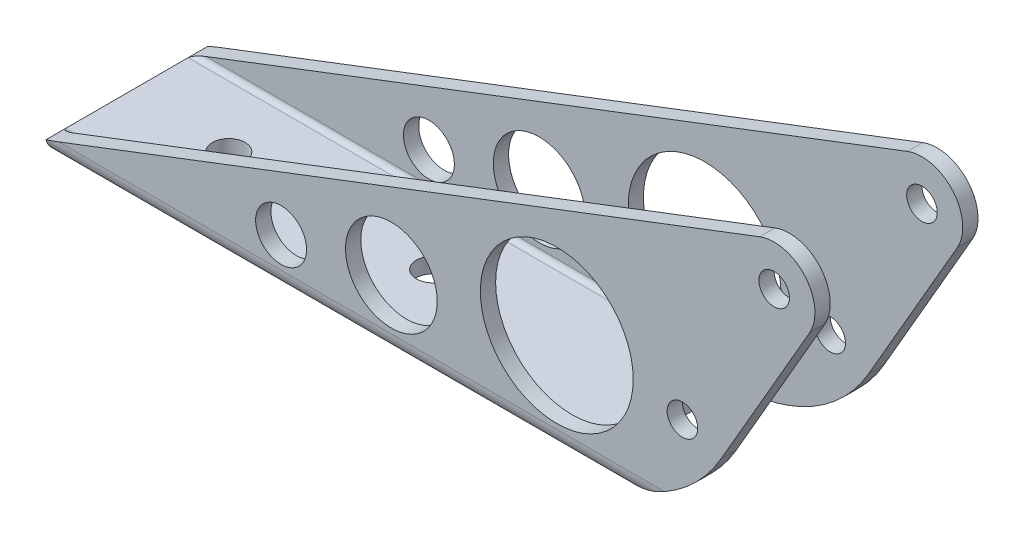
ISO-10303-21;
HEADER;
FILE_DESCRIPTION(('STEP AP214'),'2;1');
FILE_NAME('part.step','',(''),(''),'','','');
FILE_SCHEMA(('AUTOMOTIVE_DESIGN { 1 0 10303 214 1 1 1 1 }'));
ENDSEC;
DATA;
#1=APPLICATION_CONTEXT('core data for automotive mechanical design processes');
#2=APPLICATION_PROTOCOL_DEFINITION('international standard','automotive_design',2000,#1);
#3=PRODUCT_CONTEXT('',#1,'mechanical');
#4=PRODUCT('Part','Part','',(#3));
#5=PRODUCT_RELATED_PRODUCT_CATEGORY('part','',(#4));
#6=PRODUCT_DEFINITION_FORMATION('','',#4);
#7=PRODUCT_DEFINITION_CONTEXT('part definition',#1,'design');
#8=PRODUCT_DEFINITION('design','',#6,#7);
#9=PRODUCT_DEFINITION_SHAPE('','',#8);
#10=(LENGTH_UNIT() NAMED_UNIT(*) SI_UNIT(.MILLI.,.METRE.));
#11=(NAMED_UNIT(*) PLANE_ANGLE_UNIT() SI_UNIT($,.RADIAN.));
#12=(NAMED_UNIT(*) SI_UNIT($,.STERADIAN.) SOLID_ANGLE_UNIT());
#13=UNCERTAINTY_MEASURE_WITH_UNIT(LENGTH_MEASURE(1.E-05),#10,'distance_accuracy_value','');
#14=(GEOMETRIC_REPRESENTATION_CONTEXT(3) GLOBAL_UNCERTAINTY_ASSIGNED_CONTEXT((#13)) GLOBAL_UNIT_ASSIGNED_CONTEXT((#10,
#11,#12)) REPRESENTATION_CONTEXT('',''));
#15=CARTESIAN_POINT('',(0.,0.,0.));
#16=DIRECTION('',(0.,0.,1.));
#17=DIRECTION('',(1.,0.,0.));
#18=AXIS2_PLACEMENT_3D('',#15,#16,#17);
#19=CARTESIAN_POINT('',(106.524791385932,30.,-16.));
#20=DIRECTION('',(0.,0.,1.));
#21=DIRECTION('',(1.,0.,0.));
#22=AXIS2_PLACEMENT_3D('',#19,#20,#21);
#23=CYLINDRICAL_SURFACE('',#22,30.);
#24=CARTESIAN_POINT('',(106.524791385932,30.,-13.));
#25=DIRECTION('',(0.,0.,1.));
#26=DIRECTION('',(1.,0.,0.));
#27=AXIS2_PLACEMENT_3D('',#24,#25,#26);
#28=CIRCLE('',#27,30.);
#29=CARTESIAN_POINT('',(109.282483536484,0.127016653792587,-13.));
#30=VERTEX_POINT('',#29);
#31=CARTESIAN_POINT('',(132.505553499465,15.0000000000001,-13.));
#32=VERTEX_POINT('',#31);
#33=EDGE_CURVE('E236',#30,#32,#28,.T.);
#34=ORIENTED_EDGE('',*,*,#33,.F.);
#35=CARTESIAN_POINT('',(121.491420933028,4.,-16.));
#36=CARTESIAN_POINT('',(121.274329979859,3.87502624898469,-15.9999637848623));
#37=CARTESIAN_POINT('',(121.055719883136,3.75281291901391,-15.9941450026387));
#38=CARTESIAN_POINT('',(120.615999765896,3.51414923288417,-15.9722001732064));
#39=CARTESIAN_POINT('',(120.394890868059,3.39769640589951,-15.9560785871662));
#40=CARTESIAN_POINT('',(119.951007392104,3.17093489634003,-15.9148288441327));
#41=CARTESIAN_POINT('',(119.728237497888,3.06061336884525,-15.8897204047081));
#42=CARTESIAN_POINT('',(119.28086847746,2.8459197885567,-15.8315098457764));
#43=CARTESIAN_POINT('',(119.056269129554,2.74154846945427,-15.7984067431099));
#44=CARTESIAN_POINT('',(118.382335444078,2.43842402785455,-15.6888415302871));
#45=CARTESIAN_POINT('',(117.930670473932,2.24854112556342,-15.6019010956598));
#46=CARTESIAN_POINT('',(117.022589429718,1.89244949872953,-15.4058122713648));
#47=CARTESIAN_POINT('',(116.566169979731,1.72625902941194,-15.296646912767));
#48=CARTESIAN_POINT('',(115.715942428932,1.4396433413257,-15.0776991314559));
#49=CARTESIAN_POINT('',(115.322580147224,1.3160739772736,-14.9702680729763));
#50=CARTESIAN_POINT('',(114.533895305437,1.08593683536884,-14.7448449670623));
#51=CARTESIAN_POINT('',(114.138572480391,0.979371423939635,-14.6268514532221));
#52=CARTESIAN_POINT('',(112.950047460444,0.68477221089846,-14.2600304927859));
#53=CARTESIAN_POINT('',(112.154432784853,0.521883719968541,-13.9984011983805));
#54=CARTESIAN_POINT('',(110.559143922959,0.26150355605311,-13.4542066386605));
#55=CARTESIAN_POINT('',(109.759466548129,0.164075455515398,-13.1716213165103));
#56=CARTESIAN_POINT('',(108.158862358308,0.0337898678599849,-12.596624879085));
#57=CARTESIAN_POINT('',(107.357936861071,0.000885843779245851,-12.3042210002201));
#58=CARTESIAN_POINT('',(106.546484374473,5.8847660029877E-06,-12.007921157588));
#59=CARTESIAN_POINT('',(106.535637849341,2.55874423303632E-09,-12.003960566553));
#60=CARTESIAN_POINT('',(106.524791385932,0.,-12.));
#61=B_SPLINE_CURVE_WITH_KNOTS('',3,(#35,#36,#37,#38,#39,#40,#41,#42,#43,#44,#45,#46,#47,#48,#49,
#50,#51,#52,#53,#54,#55,#56,#57,#58,#59,#60),.UNSPECIFIED.,.F.,.F.,(4,2,2,2,2,2,2,2,2,2,2,2,4),
(0.,0.751306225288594,1.50228735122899,2.25163078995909,3.00106642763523,4.49253595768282,
5.98514853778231,7.26287826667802,8.54078566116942,11.0970690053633,13.6558313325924,
16.2127475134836,16.24738853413),.UNSPECIFIED.);
#62=CARTESIAN_POINT('',(121.491420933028,3.99999999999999,-16.));
#63=VERTEX_POINT('',#62);
#64=EDGE_CURVE('E11',#30,#63,#61,.F.);
#65=ORIENTED_EDGE('',*,*,#64,.T.);
#66=CARTESIAN_POINT('',(106.524791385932,30.,-16.));
#67=DIRECTION('',(0.,0.,1.));
#68=DIRECTION('',(1.,0.,0.));
#69=AXIS2_PLACEMENT_3D('',#66,#67,#68);
#70=CIRCLE('',#69,30.);
#71=CARTESIAN_POINT('',(132.505553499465,15.0000000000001,-16.));
#72=VERTEX_POINT('',#71);
#73=EDGE_CURVE('E268',#63,#72,#70,.T.);
#74=ORIENTED_EDGE('',*,*,#73,.T.);
#75=DIRECTION('',(0.,0.,1.));
#76=VECTOR('',#75,1.);
#77=CARTESIAN_POINT('',(132.505553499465,15.0000000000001,-16.));
#78=LINE('',#77,#76);
#79=EDGE_CURVE('E340',#72,#32,#78,.T.);
#80=ORIENTED_EDGE('',*,*,#79,.T.);
#81=EDGE_LOOP('',(#34,#65,#74,#80));
#82=FACE_BOUND('',#81,.T.);
#83=ADVANCED_FACE('F33',(#82),#23,.T.);
#84=CARTESIAN_POINT('',(160.,4.,-16.));
#85=DIRECTION('',(0.,0.,1.));
#86=DIRECTION('',(1.,0.,0.));
#87=AXIS2_PLACEMENT_3D('',#84,#85,#86);
#88=PLANE('',#87);
#89=CARTESIAN_POINT('',(143.,49.1769145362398,-16.));
#90=DIRECTION('',(0.,0.,1.));
#91=DIRECTION('',(1.,0.,0.));
#92=AXIS2_PLACEMENT_3D('',#89,#90,#91);
#93=CIRCLE('',#92,3.);
#94=CARTESIAN_POINT('',(146.,49.1769145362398,-16.));
#95=VERTEX_POINT('',#94);
#96=EDGE_CURVE('E420',#95,#95,#93,.T.);
#97=ORIENTED_EDGE('',*,*,#96,.T.);
#98=EDGE_LOOP('',(#97));
#99=FACE_BOUND('',#98,.T.);
#100=CARTESIAN_POINT('',(125.,18.,-16.));
#101=DIRECTION('',(0.,0.,1.));
#102=DIRECTION('',(1.,0.,0.));
#103=AXIS2_PLACEMENT_3D('',#100,#101,#102);
#104=CIRCLE('',#103,3.);
#105=CARTESIAN_POINT('',(128.,18.,-16.));
#106=VERTEX_POINT('',#105);
#107=EDGE_CURVE('E410',#106,#106,#104,.T.);
#108=ORIENTED_EDGE('',*,*,#107,.T.);
#109=EDGE_LOOP('',(#108));
#110=FACE_BOUND('',#109,.T.);
#111=CARTESIAN_POINT('',(100.348838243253,20.,-16.));
#112=DIRECTION('',(0.,0.,1.));
#113=DIRECTION('',(1.,0.,0.));
#114=AXIS2_PLACEMENT_3D('',#111,#112,#113);
#115=CIRCLE('',#114,15.);
#116=CARTESIAN_POINT('',(115.348838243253,20.,-16.));
#117=VERTEX_POINT('',#116);
#118=EDGE_CURVE('E398',#117,#117,#115,.T.);
#119=ORIENTED_EDGE('',*,*,#118,.T.);
#120=EDGE_LOOP('',(#119));
#121=FACE_BOUND('',#120,.T.);
#122=CARTESIAN_POINT('',(67.8932047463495,14.,-16.));
#123=DIRECTION('',(0.,0.,1.));
#124=DIRECTION('',(1.,0.,0.));
#125=AXIS2_PLACEMENT_3D('',#122,#123,#124);
#126=CIRCLE('',#125,9.);
#127=CARTESIAN_POINT('',(76.8932047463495,14.,-16.));
#128=VERTEX_POINT('',#127);
#129=EDGE_CURVE('E386',#128,#128,#126,.T.);
#130=ORIENTED_EDGE('',*,*,#129,.T.);
#131=EDGE_LOOP('',(#130));
#132=FACE_BOUND('',#131,.T.);
#133=CARTESIAN_POINT('',(46.2561157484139,10.,-16.));
#134=DIRECTION('',(0.,0.,1.));
#135=DIRECTION('',(1.,0.,0.));
#136=AXIS2_PLACEMENT_3D('',#133,#134,#135);
#137=CIRCLE('',#136,5.);
#138=CARTESIAN_POINT('',(51.2561157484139,10.,-16.));
#139=VERTEX_POINT('',#138);
#140=EDGE_CURVE('E374',#139,#139,#137,.T.);
#141=ORIENTED_EDGE('',*,*,#140,.T.);
#142=EDGE_LOOP('',(#141));
#143=FACE_BOUND('',#142,.T.);
#144=DIRECTION('',(-0.933906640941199,-0.357516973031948,0.));
#145=VECTOR('',#144,1.);
#146=CARTESIAN_POINT('',(140.139864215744,56.6481676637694,-16.));
#147=LINE('',#146,#145);
#148=CARTESIAN_POINT('',(140.139864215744,56.6481676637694,-16.));
#149=VERTEX_POINT('',#148);
#150=CARTESIAN_POINT('',(2.61220224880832,4.,-16.));
#151=VERTEX_POINT('',#150);
#152=EDGE_CURVE('E266',#149,#151,#147,.T.);
#153=ORIENTED_EDGE('',*,*,#152,.F.);
#154=CARTESIAN_POINT('',(143.,49.1769145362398,-16.));
#155=DIRECTION('',(0.,0.,1.));
#156=DIRECTION('',(1.,0.,0.));
#157=AXIS2_PLACEMENT_3D('',#154,#155,#156);
#158=CIRCLE('',#157,8.);
#159=CARTESIAN_POINT('',(149.928203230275,45.1769145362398,-16.));
#160=VERTEX_POINT('',#159);
#161=EDGE_CURVE('E333',#160,#149,#158,.T.);
#162=ORIENTED_EDGE('',*,*,#161,.F.);
#163=DIRECTION('',(0.499999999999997,0.866025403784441,0.));
#164=VECTOR('',#163,1.);
#165=CARTESIAN_POINT('',(132.505553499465,15.0000000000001,-16.));
#166=LINE('',#165,#164);
#167=EDGE_CURVE('E330',#72,#160,#166,.T.);
#168=ORIENTED_EDGE('',*,*,#167,.F.);
#169=ORIENTED_EDGE('',*,*,#73,.F.);
#170=DIRECTION('',(-1.,0.,0.));
#171=VECTOR('',#170,1.);
#172=CARTESIAN_POINT('',(160.,4.,-16.));
#173=LINE('',#172,#171);
#174=EDGE_CURVE('E258',#63,#151,#173,.T.);
#175=ORIENTED_EDGE('',*,*,#174,.T.);
#176=EDGE_LOOP('',(#153,#162,#168,#169,#175));
#177=FACE_BOUND('',#176,.T.);
#178=ADVANCED_FACE('F35',(#99,#110,#121,#132,#143,#177),#88,.F.);
#179=CARTESIAN_POINT('',(160.,4.,-13.));
#180=DIRECTION('',(0.,0.,1.));
#181=DIRECTION('',(1.,0.,0.));
#182=AXIS2_PLACEMENT_3D('',#179,#180,#181);
#183=PLANE('',#182);
#184=CARTESIAN_POINT('',(143.,49.1769145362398,-13.));
#185=DIRECTION('',(0.,0.,1.));
#186=DIRECTION('',(1.,0.,0.));
#187=AXIS2_PLACEMENT_3D('',#184,#185,#186);
#188=CIRCLE('',#187,3.);
#189=CARTESIAN_POINT('',(146.,49.1769145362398,-13.));
#190=VERTEX_POINT('',#189);
#191=EDGE_CURVE('E413',#190,#190,#188,.T.);
#192=ORIENTED_EDGE('',*,*,#191,.F.);
#193=EDGE_LOOP('',(#192));
#194=FACE_BOUND('',#193,.T.);
#195=CARTESIAN_POINT('',(125.,18.,-13.));
#196=DIRECTION('',(0.,0.,1.));
#197=DIRECTION('',(1.,0.,0.));
#198=AXIS2_PLACEMENT_3D('',#195,#196,#197);
#199=CIRCLE('',#198,3.);
#200=CARTESIAN_POINT('',(128.,18.,-13.));
#201=VERTEX_POINT('',#200);
#202=EDGE_CURVE('E404',#201,#201,#199,.T.);
#203=ORIENTED_EDGE('',*,*,#202,.F.);
#204=EDGE_LOOP('',(#203));
#205=FACE_BOUND('',#204,.T.);
#206=CARTESIAN_POINT('',(100.348838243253,20.,-13.));
#207=DIRECTION('',(0.,0.,1.));
#208=DIRECTION('',(1.,0.,0.));
#209=AXIS2_PLACEMENT_3D('',#206,#207,#208);
#210=CIRCLE('',#209,15.);
#211=CARTESIAN_POINT('',(115.348838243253,20.,-13.));
#212=VERTEX_POINT('',#211);
#213=EDGE_CURVE('E392',#212,#212,#210,.T.);
#214=ORIENTED_EDGE('',*,*,#213,.F.);
#215=EDGE_LOOP('',(#214));
#216=FACE_BOUND('',#215,.T.);
#217=CARTESIAN_POINT('',(67.8932047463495,14.,-13.));
#218=DIRECTION('',(0.,0.,1.));
#219=DIRECTION('',(1.,0.,0.));
#220=AXIS2_PLACEMENT_3D('',#217,#218,#219);
#221=CIRCLE('',#220,9.);
#222=CARTESIAN_POINT('',(76.8932047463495,14.,-13.));
#223=VERTEX_POINT('',#222);
#224=EDGE_CURVE('E380',#223,#223,#221,.T.);
#225=ORIENTED_EDGE('',*,*,#224,.F.);
#226=EDGE_LOOP('',(#225));
#227=FACE_BOUND('',#226,.T.);
#228=CARTESIAN_POINT('',(46.2561157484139,10.,-13.));
#229=DIRECTION('',(0.,0.,1.));
#230=DIRECTION('',(1.,0.,0.));
#231=AXIS2_PLACEMENT_3D('',#228,#229,#230);
#232=CIRCLE('',#231,5.);
#233=CARTESIAN_POINT('',(51.2561157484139,10.,-13.));
#234=VERTEX_POINT('',#233);
#235=EDGE_CURVE('E175',#234,#234,#232,.T.);
#236=ORIENTED_EDGE('',*,*,#235,.F.);
#237=EDGE_LOOP('',(#236));
#238=FACE_BOUND('',#237,.T.);
#239=DIRECTION('',(-1.,0.,0.));
#240=VECTOR('',#239,1.);
#241=CARTESIAN_POINT('',(160.,4.,-13.));
#242=LINE('',#241,#240);
#243=CARTESIAN_POINT('',(106.524791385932,4.,-13.));
#244=VERTEX_POINT('',#243);
#245=CARTESIAN_POINT('',(2.61220224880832,4.,-13.));
#246=VERTEX_POINT('',#245);
#247=EDGE_CURVE('E191',#244,#246,#242,.T.);
#248=ORIENTED_EDGE('',*,*,#247,.F.);
#249=DIRECTION('',(0.,-1.,0.));
#250=VECTOR('',#249,1.);
#251=CARTESIAN_POINT('',(106.524791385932,57.1769145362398,-13.));
#252=LINE('',#251,#250);
#253=CARTESIAN_POINT('',(106.524791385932,0.127016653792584,-13.));
#254=VERTEX_POINT('',#253);
#255=EDGE_CURVE('E174',#244,#254,#252,.T.);
#256=ORIENTED_EDGE('',*,*,#255,.T.);
#257=DIRECTION('',(-1.,0.,0.));
#258=VECTOR('',#257,1.);
#259=CARTESIAN_POINT('',(160.,0.127016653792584,-13.));
#260=LINE('',#259,#258);
#261=EDGE_CURVE('E312',#30,#254,#260,.T.);
#262=ORIENTED_EDGE('',*,*,#261,.F.);
#263=ORIENTED_EDGE('',*,*,#33,.T.);
#264=DIRECTION('',(0.499999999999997,0.86602540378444,0.));
#265=VECTOR('',#264,1.);
#266=CARTESIAN_POINT('',(134.616025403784,18.6554445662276,-13.));
#267=LINE('',#266,#265);
#268=CARTESIAN_POINT('',(149.928203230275,45.1769145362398,-13.));
#269=VERTEX_POINT('',#268);
#270=EDGE_CURVE('E242',#32,#269,#267,.T.);
#271=ORIENTED_EDGE('',*,*,#270,.T.);
#272=CARTESIAN_POINT('',(143.,49.1769145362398,-13.));
#273=DIRECTION('',(0.,0.,1.));
#274=DIRECTION('',(1.,0.,0.));
#275=AXIS2_PLACEMENT_3D('',#272,#273,#274);
#276=CIRCLE('',#275,8.);
#277=CARTESIAN_POINT('',(140.139864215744,56.6481676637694,-13.));
#278=VERTEX_POINT('',#277);
#279=EDGE_CURVE('E247',#269,#278,#276,.T.);
#280=ORIENTED_EDGE('',*,*,#279,.T.);
#281=DIRECTION('',(-0.933906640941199,-0.357516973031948,0.));
#282=VECTOR('',#281,1.);
#283=CARTESIAN_POINT('',(139.882945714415,56.549814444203,-13.));
#284=LINE('',#283,#282);
#285=EDGE_CURVE('E233',#278,#246,#284,.T.);
#286=ORIENTED_EDGE('',*,*,#285,.T.);
#287=EDGE_LOOP('',(#248,#256,#262,#263,#271,#280,#286));
#288=FACE_BOUND('',#287,.T.);
#289=ADVANCED_FACE('F298',(#194,#205,#216,#227,#238,#288),#183,.T.);
#290=CARTESIAN_POINT('',(160.,4.,-12.));
#291=DIRECTION('',(-1.,0.,0.));
#292=DIRECTION('',(0.,0.,1.));
#293=AXIS2_PLACEMENT_3D('',#290,#291,#292);
#294=CYLINDRICAL_SURFACE('',#293,1.);
#295=CARTESIAN_POINT('',(106.524791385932,4.,-12.));
#296=DIRECTION('',(-1.,0.,0.));
#297=DIRECTION('',(0.,0.,1.));
#298=AXIS2_PLACEMENT_3D('',#295,#296,#297);
#299=CIRCLE('',#298,1.);
#300=CARTESIAN_POINT('',(106.524791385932,3.,-12.));
#301=VERTEX_POINT('',#300);
#302=EDGE_CURVE('E302',#244,#301,#299,.T.);
#303=ORIENTED_EDGE('',*,*,#302,.F.);
#304=ORIENTED_EDGE('',*,*,#247,.T.);
#305=CARTESIAN_POINT('',(2.61220224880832,4.,-12.));
#306=DIRECTION('',(-0.357516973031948,0.933906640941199,0.));
#307=DIRECTION('',(-0.933906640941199,-0.357516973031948,0.));
#308=AXIS2_PLACEMENT_3D('',#305,#306,#307);
#309=ELLIPSE('',#308,2.79707000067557,1.);
#310=CARTESIAN_POINT('',(0.,3.,-12.));
#311=VERTEX_POINT('',#310);
#312=EDGE_CURVE('E290',#246,#311,#309,.T.);
#313=ORIENTED_EDGE('',*,*,#312,.T.);
#314=DIRECTION('',(-1.,0.,0.));
#315=VECTOR('',#314,1.);
#316=CARTESIAN_POINT('',(160.,3.,-12.));
#317=LINE('',#316,#315);
#318=EDGE_CURVE('E184',#301,#311,#317,.T.);
#319=ORIENTED_EDGE('',*,*,#318,.F.);
#320=EDGE_LOOP('',(#303,#304,#313,#319));
#321=FACE_BOUND('',#320,.T.);
#322=ADVANCED_FACE('F301',(#321),#294,.F.);
#323=CARTESIAN_POINT('',(160.,3.,12.));
#324=DIRECTION('',(0.,1.,0.));
#325=DIRECTION('',(0.,0.,1.));
#326=AXIS2_PLACEMENT_3D('',#323,#324,#325);
#327=PLANE('',#326);
#328=CARTESIAN_POINT('',(20.,3.,0.));
#329=DIRECTION('',(0.,1.,0.));
#330=DIRECTION('',(0.,0.,1.));
#331=AXIS2_PLACEMENT_3D('',#328,#329,#330);
#332=CIRCLE('',#331,3.19999999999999);
#333=CARTESIAN_POINT('',(20.,3.,3.19999999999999));
#334=VERTEX_POINT('',#333);
#335=EDGE_CURVE('E37',#334,#334,#332,.T.);
#336=ORIENTED_EDGE('',*,*,#335,.F.);
#337=EDGE_LOOP('',(#336));
#338=FACE_BOUND('',#337,.T.);
#339=CARTESIAN_POINT('',(60.,3.,0.));
#340=DIRECTION('',(0.,1.,0.));
#341=DIRECTION('',(0.,0.,1.));
#342=AXIS2_PLACEMENT_3D('',#339,#340,#341);
#343=CIRCLE('',#342,3.19999999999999);
#344=CARTESIAN_POINT('',(60.,3.,3.19999999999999));
#345=VERTEX_POINT('',#344);
#346=EDGE_CURVE('E423',#345,#345,#343,.T.);
#347=ORIENTED_EDGE('',*,*,#346,.F.);
#348=EDGE_LOOP('',(#347));
#349=FACE_BOUND('',#348,.T.);
#350=DIRECTION('',(0.,0.,1.));
#351=VECTOR('',#350,1.);
#352=CARTESIAN_POINT('',(106.524791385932,3.,12.));
#353=LINE('',#352,#351);
#354=CARTESIAN_POINT('',(106.524791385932,3.,12.));
#355=VERTEX_POINT('',#354);
#356=EDGE_CURVE('E162',#301,#355,#353,.T.);
#357=ORIENTED_EDGE('',*,*,#356,.F.);
#358=ORIENTED_EDGE('',*,*,#318,.T.);
#359=DIRECTION('',(0.,0.,-1.));
#360=VECTOR('',#359,1.);
#361=CARTESIAN_POINT('',(0.,3.,12.));
#362=LINE('',#361,#360);
#363=CARTESIAN_POINT('',(0.,3.,12.));
#364=VERTEX_POINT('',#363);
#365=EDGE_CURVE('E249',#364,#311,#362,.T.);
#366=ORIENTED_EDGE('',*,*,#365,.F.);
#367=DIRECTION('',(-1.,0.,0.));
#368=VECTOR('',#367,1.);
#369=CARTESIAN_POINT('',(160.,3.,12.));
#370=LINE('',#369,#368);
#371=EDGE_CURVE('E181',#355,#364,#370,.T.);
#372=ORIENTED_EDGE('',*,*,#371,.F.);
#373=EDGE_LOOP('',(#357,#358,#366,#372));
#374=FACE_BOUND('',#373,.T.);
#375=ADVANCED_FACE('F310',(#338,#349,#374),#327,.T.);
#376=CARTESIAN_POINT('',(160.,4.,12.));
#377=DIRECTION('',(-1.,0.,0.));
#378=DIRECTION('',(0.,0.,1.));
#379=AXIS2_PLACEMENT_3D('',#376,#377,#378);
#380=CYLINDRICAL_SURFACE('',#379,1.);
#381=CARTESIAN_POINT('',(106.524791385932,4.,12.));
#382=DIRECTION('',(-1.,0.,0.));
#383=DIRECTION('',(0.,0.,1.));
#384=AXIS2_PLACEMENT_3D('',#381,#382,#383);
#385=CIRCLE('',#384,1.);
#386=CARTESIAN_POINT('',(106.524791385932,4.,13.));
#387=VERTEX_POINT('',#386);
#388=EDGE_CURVE('E156',#355,#387,#385,.T.);
#389=ORIENTED_EDGE('',*,*,#388,.F.);
#390=ORIENTED_EDGE('',*,*,#371,.T.);
#391=CARTESIAN_POINT('',(2.61220224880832,4.,12.));
#392=DIRECTION('',(-0.357516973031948,0.933906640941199,0.));
#393=DIRECTION('',(-0.933906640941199,-0.357516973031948,0.));
#394=AXIS2_PLACEMENT_3D('',#391,#392,#393);
#395=ELLIPSE('',#394,2.79707000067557,1.);
#396=CARTESIAN_POINT('',(2.61220224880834,4.,13.));
#397=VERTEX_POINT('',#396);
#398=EDGE_CURVE('E180',#364,#397,#395,.T.);
#399=ORIENTED_EDGE('',*,*,#398,.T.);
#400=DIRECTION('',(-1.,0.,0.));
#401=VECTOR('',#400,1.);
#402=CARTESIAN_POINT('',(160.,4.,13.));
#403=LINE('',#402,#401);
#404=EDGE_CURVE('E170',#387,#397,#403,.T.);
#405=ORIENTED_EDGE('',*,*,#404,.F.);
#406=EDGE_LOOP('',(#389,#390,#399,#405));
#407=FACE_BOUND('',#406,.T.);
#408=ADVANCED_FACE('F178',(#407),#380,.F.);
#409=CARTESIAN_POINT('',(160.,60.,13.));
#410=DIRECTION('',(0.,0.,-1.));
#411=DIRECTION('',(-1.,0.,0.));
#412=AXIS2_PLACEMENT_3D('',#409,#410,#411);
#413=PLANE('',#412);
#414=CARTESIAN_POINT('',(143.,49.1769145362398,13.));
#415=DIRECTION('',(0.,0.,-1.));
#416=DIRECTION('',(-1.,0.,0.));
#417=AXIS2_PLACEMENT_3D('',#414,#415,#416);
#418=CIRCLE('',#417,3.);
#419=CARTESIAN_POINT('',(140.,49.1769145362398,13.));
#420=VERTEX_POINT('',#419);
#421=EDGE_CURVE('E416',#420,#420,#418,.T.);
#422=ORIENTED_EDGE('',*,*,#421,.F.);
#423=EDGE_LOOP('',(#422));
#424=FACE_BOUND('',#423,.T.);
#425=CARTESIAN_POINT('',(125.,18.,13.));
#426=DIRECTION('',(0.,0.,-1.));
#427=DIRECTION('',(-1.,0.,0.));
#428=AXIS2_PLACEMENT_3D('',#425,#426,#427);
#429=CIRCLE('',#428,3.);
#430=CARTESIAN_POINT('',(122.,18.,13.));
#431=VERTEX_POINT('',#430);
#432=EDGE_CURVE('E201',#431,#431,#429,.T.);
#433=ORIENTED_EDGE('',*,*,#432,.F.);
#434=EDGE_LOOP('',(#433));
#435=FACE_BOUND('',#434,.T.);
#436=CARTESIAN_POINT('',(100.348838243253,20.,13.));
#437=DIRECTION('',(0.,0.,-1.));
#438=DIRECTION('',(-1.,0.,0.));
#439=AXIS2_PLACEMENT_3D('',#436,#437,#438);
#440=CIRCLE('',#439,15.);
#441=CARTESIAN_POINT('',(85.3488382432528,20.,13.));
#442=VERTEX_POINT('',#441);
#443=EDGE_CURVE('E395',#442,#442,#440,.T.);
#444=ORIENTED_EDGE('',*,*,#443,.F.);
#445=EDGE_LOOP('',(#444));
#446=FACE_BOUND('',#445,.T.);
#447=CARTESIAN_POINT('',(67.8932047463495,14.,13.));
#448=DIRECTION('',(0.,0.,-1.));
#449=DIRECTION('',(-1.,0.,0.));
#450=AXIS2_PLACEMENT_3D('',#447,#448,#449);
#451=CIRCLE('',#450,9.);
#452=CARTESIAN_POINT('',(58.8932047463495,14.,13.));
#453=VERTEX_POINT('',#452);
#454=EDGE_CURVE('E383',#453,#453,#451,.T.);
#455=ORIENTED_EDGE('',*,*,#454,.F.);
#456=EDGE_LOOP('',(#455));
#457=FACE_BOUND('',#456,.T.);
#458=CARTESIAN_POINT('',(46.2561157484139,10.,13.));
#459=DIRECTION('',(0.,0.,-1.));
#460=DIRECTION('',(-1.,0.,0.));
#461=AXIS2_PLACEMENT_3D('',#458,#459,#460);
#462=CIRCLE('',#461,5.);
#463=CARTESIAN_POINT('',(41.2561157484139,10.,13.));
#464=VERTEX_POINT('',#463);
#465=EDGE_CURVE('E371',#464,#464,#462,.T.);
#466=ORIENTED_EDGE('',*,*,#465,.F.);
#467=EDGE_LOOP('',(#466));
#468=FACE_BOUND('',#467,.T.);
#469=DIRECTION('',(0.933906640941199,0.357516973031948,0.));
#470=VECTOR('',#469,1.);
#471=CARTESIAN_POINT('',(158.580644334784,63.7076440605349,13.));
#472=LINE('',#471,#470);
#473=CARTESIAN_POINT('',(140.139864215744,56.6481676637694,13.));
#474=VERTEX_POINT('',#473);
#475=EDGE_CURVE('E280',#397,#474,#472,.T.);
#476=ORIENTED_EDGE('',*,*,#475,.T.);
#477=CARTESIAN_POINT('',(143.,49.1769145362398,13.));
#478=DIRECTION('',(0.,0.,-1.));
#479=DIRECTION('',(-1.,0.,0.));
#480=AXIS2_PLACEMENT_3D('',#477,#478,#479);
#481=CIRCLE('',#480,8.);
#482=CARTESIAN_POINT('',(149.928203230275,45.1769145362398,13.));
#483=VERTEX_POINT('',#482);
#484=EDGE_CURVE('E245',#474,#483,#481,.T.);
#485=ORIENTED_EDGE('',*,*,#484,.T.);
#486=DIRECTION('',(-0.499999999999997,-0.86602540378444,0.));
#487=VECTOR('',#486,1.);
#488=CARTESIAN_POINT('',(158.864736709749,60.6554445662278,13.));
#489=LINE('',#488,#487);
#490=CARTESIAN_POINT('',(132.505553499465,15.0000000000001,13.));
#491=VERTEX_POINT('',#490);
#492=EDGE_CURVE('E239',#483,#491,#489,.T.);
#493=ORIENTED_EDGE('',*,*,#492,.T.);
#494=CARTESIAN_POINT('',(106.524791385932,30.,13.));
#495=DIRECTION('',(0.,0.,-1.));
#496=DIRECTION('',(-1.,0.,0.));
#497=AXIS2_PLACEMENT_3D('',#494,#495,#496);
#498=CIRCLE('',#497,30.);
#499=CARTESIAN_POINT('',(109.282483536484,0.12701665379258,13.));
#500=VERTEX_POINT('',#499);
#501=EDGE_CURVE('E232',#491,#500,#498,.T.);
#502=ORIENTED_EDGE('',*,*,#501,.T.);
#503=DIRECTION('',(-1.,0.,0.));
#504=VECTOR('',#503,1.);
#505=CARTESIAN_POINT('',(160.,0.127016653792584,13.));
#506=LINE('',#505,#504);
#507=CARTESIAN_POINT('',(106.524791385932,0.127016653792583,13.));
#508=VERTEX_POINT('',#507);
#509=EDGE_CURVE('E173',#508,#500,#506,.F.);
#510=ORIENTED_EDGE('',*,*,#509,.F.);
#511=DIRECTION('',(0.,-1.,0.));
#512=VECTOR('',#511,1.);
#513=CARTESIAN_POINT('',(106.524791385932,57.1769145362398,13.));
#514=LINE('',#513,#512);
#515=EDGE_CURVE('E159',#387,#508,#514,.T.);
#516=ORIENTED_EDGE('',*,*,#515,.F.);
#517=ORIENTED_EDGE('',*,*,#404,.T.);
#518=EDGE_LOOP('',(#476,#485,#493,#502,#510,#516,#517));
#519=FACE_BOUND('',#518,.T.);
#520=ADVANCED_FACE('F169',(#424,#435,#446,#457,#468,#519),#413,.T.);
#521=CARTESIAN_POINT('',(160.,60.,16.));
#522=DIRECTION('',(0.,0.,-1.));
#523=DIRECTION('',(-1.,0.,0.));
#524=AXIS2_PLACEMENT_3D('',#521,#522,#523);
#525=PLANE('',#524);
#526=CARTESIAN_POINT('',(143.,49.1769145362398,16.));
#527=DIRECTION('',(0.,0.,1.));
#528=DIRECTION('',(1.,0.,0.));
#529=AXIS2_PLACEMENT_3D('',#526,#527,#528);
#530=CIRCLE('',#529,3.);
#531=CARTESIAN_POINT('',(146.,49.1769145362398,16.));
#532=VERTEX_POINT('',#531);
#533=EDGE_CURVE('E417',#532,#532,#530,.T.);
#534=ORIENTED_EDGE('',*,*,#533,.F.);
#535=EDGE_LOOP('',(#534));
#536=FACE_BOUND('',#535,.T.);
#537=CARTESIAN_POINT('',(125.,18.,16.));
#538=DIRECTION('',(0.,0.,1.));
#539=DIRECTION('',(1.,0.,0.));
#540=AXIS2_PLACEMENT_3D('',#537,#538,#539);
#541=CIRCLE('',#540,3.);
#542=CARTESIAN_POINT('',(128.,18.,16.));
#543=VERTEX_POINT('',#542);
#544=EDGE_CURVE('E407',#543,#543,#541,.T.);
#545=ORIENTED_EDGE('',*,*,#544,.F.);
#546=EDGE_LOOP('',(#545));
#547=FACE_BOUND('',#546,.T.);
#548=CARTESIAN_POINT('',(100.348838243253,20.,16.));
#549=DIRECTION('',(0.,0.,1.));
#550=DIRECTION('',(1.,0.,0.));
#551=AXIS2_PLACEMENT_3D('',#548,#549,#550);
#552=CIRCLE('',#551,15.);
#553=CARTESIAN_POINT('',(115.348838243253,20.,16.));
#554=VERTEX_POINT('',#553);
#555=EDGE_CURVE('E401',#554,#554,#552,.T.);
#556=ORIENTED_EDGE('',*,*,#555,.F.);
#557=EDGE_LOOP('',(#556));
#558=FACE_BOUND('',#557,.T.);
#559=CARTESIAN_POINT('',(67.8932047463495,14.,16.));
#560=DIRECTION('',(0.,0.,1.));
#561=DIRECTION('',(1.,0.,0.));
#562=AXIS2_PLACEMENT_3D('',#559,#560,#561);
#563=CIRCLE('',#562,9.);
#564=CARTESIAN_POINT('',(76.8932047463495,14.,16.));
#565=VERTEX_POINT('',#564);
#566=EDGE_CURVE('E389',#565,#565,#563,.T.);
#567=ORIENTED_EDGE('',*,*,#566,.F.);
#568=EDGE_LOOP('',(#567));
#569=FACE_BOUND('',#568,.T.);
#570=CARTESIAN_POINT('',(46.2561157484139,10.,16.));
#571=DIRECTION('',(0.,0.,1.));
#572=DIRECTION('',(1.,0.,0.));
#573=AXIS2_PLACEMENT_3D('',#570,#571,#572);
#574=CIRCLE('',#573,5.);
#575=CARTESIAN_POINT('',(51.2561157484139,10.,16.));
#576=VERTEX_POINT('',#575);
#577=EDGE_CURVE('E377',#576,#576,#574,.T.);
#578=ORIENTED_EDGE('',*,*,#577,.F.);
#579=EDGE_LOOP('',(#578));
#580=FACE_BOUND('',#579,.T.);
#581=DIRECTION('',(-0.933906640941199,-0.357516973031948,0.));
#582=VECTOR('',#581,1.);
#583=CARTESIAN_POINT('',(140.139864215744,56.6481676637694,16.));
#584=LINE('',#583,#582);
#585=CARTESIAN_POINT('',(140.139864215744,56.6481676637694,16.));
#586=VERTEX_POINT('',#585);
#587=CARTESIAN_POINT('',(2.61220224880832,4.,16.));
#588=VERTEX_POINT('',#587);
#589=EDGE_CURVE('E326',#586,#588,#584,.T.);
#590=ORIENTED_EDGE('',*,*,#589,.T.);
#591=DIRECTION('',(-1.,0.,0.));
#592=VECTOR('',#591,1.);
#593=CARTESIAN_POINT('',(160.,4.,16.));
#594=LINE('',#593,#592);
#595=CARTESIAN_POINT('',(121.491420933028,4.,16.));
#596=VERTEX_POINT('',#595);
#597=EDGE_CURVE('E182',#596,#588,#594,.T.);
#598=ORIENTED_EDGE('',*,*,#597,.F.);
#599=CARTESIAN_POINT('',(106.524791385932,30.,16.));
#600=DIRECTION('',(0.,0.,1.));
#601=DIRECTION('',(1.,0.,0.));
#602=AXIS2_PLACEMENT_3D('',#599,#600,#601);
#603=CIRCLE('',#602,30.);
#604=CARTESIAN_POINT('',(132.505553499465,15.0000000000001,16.));
#605=VERTEX_POINT('',#604);
#606=EDGE_CURVE('E317',#596,#605,#603,.T.);
#607=ORIENTED_EDGE('',*,*,#606,.T.);
#608=DIRECTION('',(0.499999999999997,0.866025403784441,0.));
#609=VECTOR('',#608,1.);
#610=CARTESIAN_POINT('',(132.505553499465,15.0000000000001,16.));
#611=LINE('',#610,#609);
#612=CARTESIAN_POINT('',(149.928203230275,45.1769145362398,16.));
#613=VERTEX_POINT('',#612);
#614=EDGE_CURVE('E320',#605,#613,#611,.T.);
#615=ORIENTED_EDGE('',*,*,#614,.T.);
#616=CARTESIAN_POINT('',(143.,49.1769145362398,16.));
#617=DIRECTION('',(0.,0.,1.));
#618=DIRECTION('',(1.,0.,0.));
#619=AXIS2_PLACEMENT_3D('',#616,#617,#618);
#620=CIRCLE('',#619,8.);
#621=EDGE_CURVE('E323',#613,#586,#620,.T.);
#622=ORIENTED_EDGE('',*,*,#621,.T.);
#623=EDGE_LOOP('',(#590,#598,#607,#615,#622));
#624=FACE_BOUND('',#623,.T.);
#625=ADVANCED_FACE('F221',(#536,#547,#558,#569,#580,#624),#525,.F.);
#626=CARTESIAN_POINT('',(160.,4.,12.));
#627=DIRECTION('',(-1.,0.,0.));
#628=DIRECTION('',(0.,0.,1.));
#629=AXIS2_PLACEMENT_3D('',#626,#627,#628);
#630=CYLINDRICAL_SURFACE('',#629,4.);
#631=DIRECTION('',(-1.,0.,0.));
#632=VECTOR('',#631,1.);
#633=CARTESIAN_POINT('',(160.,0.,12.));
#634=LINE('',#633,#632);
#635=CARTESIAN_POINT('',(106.524791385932,0.,12.));
#636=VERTEX_POINT('',#635);
#637=CARTESIAN_POINT('',(0.,0.,12.));
#638=VERTEX_POINT('',#637);
#639=EDGE_CURVE('E57',#636,#638,#634,.T.);
#640=ORIENTED_EDGE('',*,*,#639,.F.);
#641=CARTESIAN_POINT('',(106.524791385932,4.,12.));
#642=DIRECTION('',(-1.,0.,0.));
#643=DIRECTION('',(0.,0.,1.));
#644=AXIS2_PLACEMENT_3D('',#641,#642,#643);
#645=CIRCLE('',#644,4.);
#646=EDGE_CURVE('E166',#636,#508,#645,.T.);
#647=ORIENTED_EDGE('',*,*,#646,.T.);
#648=ORIENTED_EDGE('',*,*,#509,.T.);
#649=CARTESIAN_POINT('',(121.491420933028,4.,16.));
#650=CARTESIAN_POINT('',(121.274329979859,3.87502624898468,15.9999637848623));
#651=CARTESIAN_POINT('',(121.055719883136,3.7528129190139,15.9941450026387));
#652=CARTESIAN_POINT('',(120.615999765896,3.51414923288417,15.9722001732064));
#653=CARTESIAN_POINT('',(120.394890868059,3.39769640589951,15.9560785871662));
#654=CARTESIAN_POINT('',(119.951007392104,3.17093489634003,15.9148288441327));
#655=CARTESIAN_POINT('',(119.728237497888,3.06061336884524,15.8897204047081));
#656=CARTESIAN_POINT('',(119.28086847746,2.84591978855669,15.8315098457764));
#657=CARTESIAN_POINT('',(119.056269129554,2.74154846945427,15.7984067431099));
#658=CARTESIAN_POINT('',(118.382335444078,2.43842402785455,15.6888415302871));
#659=CARTESIAN_POINT('',(117.930670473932,2.24854112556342,15.6019010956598));
#660=CARTESIAN_POINT('',(117.022589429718,1.89244949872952,15.4058122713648));
#661=CARTESIAN_POINT('',(116.566169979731,1.72625902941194,15.296646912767));
#662=CARTESIAN_POINT('',(115.715942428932,1.4396433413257,15.0776991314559));
#663=CARTESIAN_POINT('',(115.322580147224,1.31607397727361,14.9702680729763));
#664=CARTESIAN_POINT('',(114.533895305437,1.08593683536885,14.7448449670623));
#665=CARTESIAN_POINT('',(114.138572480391,0.97937142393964,14.6268514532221));
#666=CARTESIAN_POINT('',(112.950047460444,0.684772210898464,14.2600304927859));
#667=CARTESIAN_POINT('',(112.154432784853,0.521883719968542,13.9984011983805));
#668=CARTESIAN_POINT('',(110.559143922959,0.261503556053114,13.4542066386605));
#669=CARTESIAN_POINT('',(109.759466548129,0.164075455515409,13.1716213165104));
#670=CARTESIAN_POINT('',(108.158862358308,0.0337898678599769,12.596624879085));
#671=CARTESIAN_POINT('',(107.357936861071,0.000885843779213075,12.30422100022));
#672=CARTESIAN_POINT('',(106.546484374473,5.88476600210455E-06,12.0079211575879));
#673=CARTESIAN_POINT('',(106.535637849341,2.55874378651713E-09,12.003960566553));
#674=CARTESIAN_POINT('',(106.524791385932,0.,12.));
#675=B_SPLINE_CURVE_WITH_KNOTS('',3,(#649,#650,#651,#652,#653,#654,#655,#656,#657,#658,#659,
#660,#661,#662,#663,#664,#665,#666,#667,#668,#669,#670,#671,#672,#673,#674),.UNSPECIFIED.,.F.,
.F.,(4,2,2,2,2,2,2,2,2,2,2,2,4),(0.,0.751306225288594,1.50228735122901,2.25163078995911,
3.00106642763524,4.49253595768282,5.9851485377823,7.26287826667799,8.54078566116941,
11.0970690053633,13.6558313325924,16.2127475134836,16.24738853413),.UNSPECIFIED.);
#676=EDGE_CURVE('E225',#596,#500,#675,.T.);
#677=ORIENTED_EDGE('',*,*,#676,.F.);
#678=ORIENTED_EDGE('',*,*,#597,.T.);
#679=CARTESIAN_POINT('',(2.61220224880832,4.,12.));
#680=DIRECTION('',(-0.357516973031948,0.933906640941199,0.));
#681=DIRECTION('',(-0.933906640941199,-0.357516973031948,0.));
#682=AXIS2_PLACEMENT_3D('',#679,#680,#681);
#683=ELLIPSE('',#682,11.1882800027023,4.);
#684=CARTESIAN_POINT('',(0.,3.,15.8729833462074));
#685=VERTEX_POINT('',#684);
#686=EDGE_CURVE('E277',#685,#588,#683,.T.);
#687=ORIENTED_EDGE('',*,*,#686,.F.);
#688=CARTESIAN_POINT('',(0.,4.,12.));
#689=DIRECTION('',(1.,0.,0.));
#690=DIRECTION('',(0.,0.,-1.));
#691=AXIS2_PLACEMENT_3D('',#688,#689,#690);
#692=CIRCLE('',#691,4.);
#693=EDGE_CURVE('E252',#685,#638,#692,.T.);
#694=ORIENTED_EDGE('',*,*,#693,.T.);
#695=EDGE_LOOP('',(#640,#647,#648,#677,#678,#687,#694));
#696=FACE_BOUND('',#695,.T.);
#697=ADVANCED_FACE('F212',(#696),#630,.T.);
#698=CARTESIAN_POINT('',(160.,4.,-12.));
#699=DIRECTION('',(-1.,0.,0.));
#700=DIRECTION('',(0.,0.,1.));
#701=AXIS2_PLACEMENT_3D('',#698,#699,#700);
#702=CYLINDRICAL_SURFACE('',#701,4.);
#703=ORIENTED_EDGE('',*,*,#64,.F.);
#704=ORIENTED_EDGE('',*,*,#261,.T.);
#705=CARTESIAN_POINT('',(106.524791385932,4.,-12.));
#706=DIRECTION('',(-1.,0.,0.));
#707=DIRECTION('',(0.,0.,1.));
#708=AXIS2_PLACEMENT_3D('',#705,#706,#707);
#709=CIRCLE('',#708,4.);
#710=CARTESIAN_POINT('',(106.524791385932,0.,-12.));
#711=VERTEX_POINT('',#710);
#712=EDGE_CURVE('E364',#254,#711,#709,.T.);
#713=ORIENTED_EDGE('',*,*,#712,.T.);
#714=DIRECTION('',(-1.,0.,0.));
#715=VECTOR('',#714,1.);
#716=CARTESIAN_POINT('',(160.,0.,-12.));
#717=LINE('',#716,#715);
#718=CARTESIAN_POINT('',(0.,0.,-12.));
#719=VERTEX_POINT('',#718);
#720=EDGE_CURVE('E50',#711,#719,#717,.T.);
#721=ORIENTED_EDGE('',*,*,#720,.T.);
#722=CARTESIAN_POINT('',(0.,4.,-12.));
#723=DIRECTION('',(1.,0.,0.));
#724=DIRECTION('',(0.,0.,-1.));
#725=AXIS2_PLACEMENT_3D('',#722,#723,#724);
#726=CIRCLE('',#725,4.);
#727=CARTESIAN_POINT('',(0.,3.,-15.8729833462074));
#728=VERTEX_POINT('',#727);
#729=EDGE_CURVE('E256',#719,#728,#726,.T.);
#730=ORIENTED_EDGE('',*,*,#729,.T.);
#731=CARTESIAN_POINT('',(2.61220224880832,4.,-12.));
#732=DIRECTION('',(-0.357516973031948,0.933906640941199,0.));
#733=DIRECTION('',(-0.933906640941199,-0.357516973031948,0.));
#734=AXIS2_PLACEMENT_3D('',#731,#732,#733);
#735=ELLIPSE('',#734,11.1882800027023,4.);
#736=EDGE_CURVE('E272',#151,#728,#735,.T.);
#737=ORIENTED_EDGE('',*,*,#736,.F.);
#738=ORIENTED_EDGE('',*,*,#174,.F.);
#739=EDGE_LOOP('',(#703,#704,#713,#721,#730,#737,#738));
#740=FACE_BOUND('',#739,.T.);
#741=ADVANCED_FACE('F207',(#740),#702,.T.);
#742=CARTESIAN_POINT('',(0.,4.,-12.));
#743=DIRECTION('',(1.,0.,0.));
#744=DIRECTION('',(0.,0.,-1.));
#745=AXIS2_PLACEMENT_3D('',#742,#743,#744);
#746=PLANE('',#745);
#747=DIRECTION('',(0.,0.,1.));
#748=VECTOR('',#747,1.);
#749=CARTESIAN_POINT('',(0.,3.00000000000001,-12.));
#750=LINE('',#749,#748);
#751=EDGE_CURVE('E42',#728,#311,#750,.T.);
#752=ORIENTED_EDGE('',*,*,#751,.F.);
#753=ORIENTED_EDGE('',*,*,#729,.F.);
#754=DIRECTION('',(0.,0.,-1.));
#755=VECTOR('',#754,1.);
#756=CARTESIAN_POINT('',(0.,0.,12.));
#757=LINE('',#756,#755);
#758=EDGE_CURVE('E254',#638,#719,#757,.T.);
#759=ORIENTED_EDGE('',*,*,#758,.F.);
#760=ORIENTED_EDGE('',*,*,#693,.F.);
#761=EDGE_CURVE('E194',#364,#685,#750,.T.);
#762=ORIENTED_EDGE('',*,*,#761,.F.);
#763=ORIENTED_EDGE('',*,*,#365,.T.);
#764=EDGE_LOOP('',(#752,#753,#759,#760,#762,#763));
#765=FACE_BOUND('',#764,.T.);
#766=ADVANCED_FACE('F211',(#765),#746,.F.);
#767=CARTESIAN_POINT('',(160.,0.,12.));
#768=DIRECTION('',(0.,1.,0.));
#769=DIRECTION('',(0.,0.,1.));
#770=AXIS2_PLACEMENT_3D('',#767,#768,#769);
#771=PLANE('',#770);
#772=CARTESIAN_POINT('',(20.,0.,0.));
#773=DIRECTION('',(0.,-1.,0.));
#774=DIRECTION('',(0.,0.,-1.));
#775=AXIS2_PLACEMENT_3D('',#772,#773,#774);
#776=CIRCLE('',#775,3.2);
#777=CARTESIAN_POINT('',(20.,0.,-3.2));
#778=VERTEX_POINT('',#777);
#779=EDGE_CURVE('E427',#778,#778,#776,.T.);
#780=ORIENTED_EDGE('',*,*,#779,.F.);
#781=EDGE_LOOP('',(#780));
#782=FACE_BOUND('',#781,.T.);
#783=CARTESIAN_POINT('',(60.,0.,0.));
#784=DIRECTION('',(0.,-1.,0.));
#785=DIRECTION('',(0.,0.,-1.));
#786=AXIS2_PLACEMENT_3D('',#783,#784,#785);
#787=CIRCLE('',#786,3.19999999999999);
#788=CARTESIAN_POINT('',(60.,0.,-3.19999999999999));
#789=VERTEX_POINT('',#788);
#790=EDGE_CURVE('E424',#789,#789,#787,.T.);
#791=ORIENTED_EDGE('',*,*,#790,.F.);
#792=EDGE_LOOP('',(#791));
#793=FACE_BOUND('',#792,.T.);
#794=ORIENTED_EDGE('',*,*,#720,.F.);
#795=DIRECTION('',(0.,0.,1.));
#796=VECTOR('',#795,1.);
#797=CARTESIAN_POINT('',(106.524791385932,0.,-16.));
#798=LINE('',#797,#796);
#799=EDGE_CURVE('E286',#711,#636,#798,.T.);
#800=ORIENTED_EDGE('',*,*,#799,.T.);
#801=ORIENTED_EDGE('',*,*,#639,.T.);
#802=ORIENTED_EDGE('',*,*,#758,.T.);
#803=EDGE_LOOP('',(#794,#800,#801,#802));
#804=FACE_BOUND('',#803,.T.);
#805=ADVANCED_FACE('F213',(#782,#793,#804),#771,.F.);
#806=CARTESIAN_POINT('',(143.,49.1769145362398,-16.));
#807=DIRECTION('',(0.,0.,1.));
#808=DIRECTION('',(1.,0.,0.));
#809=AXIS2_PLACEMENT_3D('',#806,#807,#808);
#810=CYLINDRICAL_SURFACE('',#809,8.);
#811=DIRECTION('',(0.,0.,1.));
#812=VECTOR('',#811,1.);
#813=CARTESIAN_POINT('',(149.928203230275,45.1769145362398,-16.));
#814=LINE('',#813,#812);
#815=EDGE_CURVE('E337',#160,#269,#814,.T.);
#816=ORIENTED_EDGE('',*,*,#815,.F.);
#817=ORIENTED_EDGE('',*,*,#161,.T.);
#818=DIRECTION('',(0.,0.,1.));
#819=VECTOR('',#818,1.);
#820=CARTESIAN_POINT('',(140.139864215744,56.6481676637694,-16.));
#821=LINE('',#820,#819);
#822=EDGE_CURVE('E278',#149,#278,#821,.T.);
#823=ORIENTED_EDGE('',*,*,#822,.T.);
#824=ORIENTED_EDGE('',*,*,#279,.F.);
#825=EDGE_LOOP('',(#816,#817,#823,#824));
#826=FACE_BOUND('',#825,.T.);
#827=ADVANCED_FACE('F216',(#826),#810,.T.);
#828=CARTESIAN_POINT('',(132.505553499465,15.0000000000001,-16.));
#829=DIRECTION('',(0.86602540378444,-0.499999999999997,0.));
#830=DIRECTION('',(0.499999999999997,0.86602540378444,0.));
#831=AXIS2_PLACEMENT_3D('',#828,#829,#830);
#832=PLANE('',#831);
#833=ORIENTED_EDGE('',*,*,#79,.F.);
#834=ORIENTED_EDGE('',*,*,#167,.T.);
#835=ORIENTED_EDGE('',*,*,#815,.T.);
#836=ORIENTED_EDGE('',*,*,#270,.F.);
#837=EDGE_LOOP('',(#833,#834,#835,#836));
#838=FACE_BOUND('',#837,.T.);
#839=ADVANCED_FACE('F478',(#838),#832,.T.);
#840=ORIENTED_EDGE('',*,*,#676,.T.);
#841=ORIENTED_EDGE('',*,*,#501,.F.);
#842=EDGE_CURVE('E342',#491,#605,#78,.T.);
#843=ORIENTED_EDGE('',*,*,#842,.T.);
#844=ORIENTED_EDGE('',*,*,#606,.F.);
#845=EDGE_LOOP('',(#840,#841,#843,#844));
#846=FACE_BOUND('',#845,.T.);
#847=ADVANCED_FACE('F203',(#846),#23,.T.);
#848=CARTESIAN_POINT('',(140.139864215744,56.6481676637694,-16.));
#849=DIRECTION('',(-0.357516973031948,0.933906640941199,0.));
#850=DIRECTION('',(-0.933906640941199,-0.357516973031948,0.));
#851=AXIS2_PLACEMENT_3D('',#848,#849,#850);
#852=PLANE('',#851);
#853=ORIENTED_EDGE('',*,*,#822,.F.);
#854=ORIENTED_EDGE('',*,*,#152,.T.);
#855=ORIENTED_EDGE('',*,*,#736,.T.);
#856=ORIENTED_EDGE('',*,*,#751,.T.);
#857=ORIENTED_EDGE('',*,*,#312,.F.);
#858=ORIENTED_EDGE('',*,*,#285,.F.);
#859=EDGE_LOOP('',(#853,#854,#855,#856,#857,#858));
#860=FACE_BOUND('',#859,.T.);
#861=ADVANCED_FACE('F303',(#860),#852,.T.);
#862=ORIENTED_EDGE('',*,*,#761,.T.);
#863=ORIENTED_EDGE('',*,*,#686,.T.);
#864=ORIENTED_EDGE('',*,*,#589,.F.);
#865=EDGE_CURVE('E283',#474,#586,#821,.T.);
#866=ORIENTED_EDGE('',*,*,#865,.F.);
#867=ORIENTED_EDGE('',*,*,#475,.F.);
#868=ORIENTED_EDGE('',*,*,#398,.F.);
#869=EDGE_LOOP('',(#862,#863,#864,#866,#867,#868));
#870=FACE_BOUND('',#869,.T.);
#871=ADVANCED_FACE('F353',(#870),#852,.T.);
#872=ORIENTED_EDGE('',*,*,#865,.T.);
#873=ORIENTED_EDGE('',*,*,#621,.F.);
#874=EDGE_CURVE('E339',#483,#613,#814,.T.);
#875=ORIENTED_EDGE('',*,*,#874,.F.);
#876=ORIENTED_EDGE('',*,*,#484,.F.);
#877=EDGE_LOOP('',(#872,#873,#875,#876));
#878=FACE_BOUND('',#877,.T.);
#879=ADVANCED_FACE('F359',(#878),#810,.T.);
#880=ORIENTED_EDGE('',*,*,#874,.T.);
#881=ORIENTED_EDGE('',*,*,#614,.F.);
#882=ORIENTED_EDGE('',*,*,#842,.F.);
#883=ORIENTED_EDGE('',*,*,#492,.F.);
#884=EDGE_LOOP('',(#880,#881,#882,#883));
#885=FACE_BOUND('',#884,.T.);
#886=ADVANCED_FACE('F363',(#885),#832,.T.);
#887=CARTESIAN_POINT('',(106.524791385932,57.1769145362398,13.));
#888=DIRECTION('',(-1.,0.,0.));
#889=DIRECTION('',(0.,0.,1.));
#890=AXIS2_PLACEMENT_3D('',#887,#888,#889);
#891=PLANE('',#890);
#892=ORIENTED_EDGE('',*,*,#302,.T.);
#893=ORIENTED_EDGE('',*,*,#356,.T.);
#894=ORIENTED_EDGE('',*,*,#388,.T.);
#895=ORIENTED_EDGE('',*,*,#515,.T.);
#896=ORIENTED_EDGE('',*,*,#646,.F.);
#897=ORIENTED_EDGE('',*,*,#799,.F.);
#898=ORIENTED_EDGE('',*,*,#712,.F.);
#899=ORIENTED_EDGE('',*,*,#255,.F.);
#900=EDGE_LOOP('',(#892,#893,#894,#895,#896,#897,#898,#899));
#901=FACE_BOUND('',#900,.T.);
#902=ADVANCED_FACE('F158',(#901),#891,.F.);
#903=CARTESIAN_POINT('',(46.2561157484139,10.,-16.));
#904=DIRECTION('',(0.,0.,1.));
#905=DIRECTION('',(1.,0.,0.));
#906=AXIS2_PLACEMENT_3D('',#903,#904,#905);
#907=CYLINDRICAL_SURFACE('',#906,5.);
#908=ORIENTED_EDGE('',*,*,#465,.T.);
#909=EDGE_LOOP('',(#908));
#910=FACE_BOUND('',#909,.T.);
#911=ORIENTED_EDGE('',*,*,#577,.T.);
#912=EDGE_LOOP('',(#911));
#913=FACE_BOUND('',#912,.T.);
#914=ADVANCED_FACE('F459',(#910,#913),#907,.F.);
#915=ORIENTED_EDGE('',*,*,#235,.T.);
#916=EDGE_LOOP('',(#915));
#917=FACE_BOUND('',#916,.T.);
#918=ORIENTED_EDGE('',*,*,#140,.F.);
#919=EDGE_LOOP('',(#918));
#920=FACE_BOUND('',#919,.T.);
#921=ADVANCED_FACE('F462',(#917,#920),#907,.F.);
#922=CARTESIAN_POINT('',(67.8932047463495,14.,-16.));
#923=DIRECTION('',(0.,0.,1.));
#924=DIRECTION('',(1.,0.,0.));
#925=AXIS2_PLACEMENT_3D('',#922,#923,#924);
#926=CYLINDRICAL_SURFACE('',#925,9.);
#927=ORIENTED_EDGE('',*,*,#454,.T.);
#928=EDGE_LOOP('',(#927));
#929=FACE_BOUND('',#928,.T.);
#930=ORIENTED_EDGE('',*,*,#566,.T.);
#931=EDGE_LOOP('',(#930));
#932=FACE_BOUND('',#931,.T.);
#933=ADVANCED_FACE('F500',(#929,#932),#926,.F.);
#934=ORIENTED_EDGE('',*,*,#224,.T.);
#935=EDGE_LOOP('',(#934));
#936=FACE_BOUND('',#935,.T.);
#937=ORIENTED_EDGE('',*,*,#129,.F.);
#938=EDGE_LOOP('',(#937));
#939=FACE_BOUND('',#938,.T.);
#940=ADVANCED_FACE('F503',(#936,#939),#926,.F.);
#941=CARTESIAN_POINT('',(100.348838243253,20.,-16.));
#942=DIRECTION('',(0.,0.,1.));
#943=DIRECTION('',(1.,0.,0.));
#944=AXIS2_PLACEMENT_3D('',#941,#942,#943);
#945=CYLINDRICAL_SURFACE('',#944,15.);
#946=ORIENTED_EDGE('',*,*,#443,.T.);
#947=EDGE_LOOP('',(#946));
#948=FACE_BOUND('',#947,.T.);
#949=ORIENTED_EDGE('',*,*,#555,.T.);
#950=EDGE_LOOP('',(#949));
#951=FACE_BOUND('',#950,.T.);
#952=ADVANCED_FACE('F505',(#948,#951),#945,.F.);
#953=ORIENTED_EDGE('',*,*,#213,.T.);
#954=EDGE_LOOP('',(#953));
#955=FACE_BOUND('',#954,.T.);
#956=ORIENTED_EDGE('',*,*,#118,.F.);
#957=EDGE_LOOP('',(#956));
#958=FACE_BOUND('',#957,.T.);
#959=ADVANCED_FACE('F508',(#955,#958),#945,.F.);
#960=CARTESIAN_POINT('',(125.,18.,16.));
#961=DIRECTION('',(0.,0.,1.));
#962=DIRECTION('',(1.,0.,0.));
#963=AXIS2_PLACEMENT_3D('',#960,#961,#962);
#964=CYLINDRICAL_SURFACE('',#963,3.);
#965=ORIENTED_EDGE('',*,*,#432,.T.);
#966=EDGE_LOOP('',(#965));
#967=FACE_BOUND('',#966,.T.);
#968=ORIENTED_EDGE('',*,*,#544,.T.);
#969=EDGE_LOOP('',(#968));
#970=FACE_BOUND('',#969,.T.);
#971=ADVANCED_FACE('F510',(#967,#970),#964,.F.);
#972=ORIENTED_EDGE('',*,*,#202,.T.);
#973=EDGE_LOOP('',(#972));
#974=FACE_BOUND('',#973,.T.);
#975=ORIENTED_EDGE('',*,*,#107,.F.);
#976=EDGE_LOOP('',(#975));
#977=FACE_BOUND('',#976,.T.);
#978=ADVANCED_FACE('F513',(#974,#977),#964,.F.);
#979=CARTESIAN_POINT('',(143.,49.1769145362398,16.));
#980=DIRECTION('',(0.,0.,1.));
#981=DIRECTION('',(1.,0.,0.));
#982=AXIS2_PLACEMENT_3D('',#979,#980,#981);
#983=CYLINDRICAL_SURFACE('',#982,3.);
#984=ORIENTED_EDGE('',*,*,#421,.T.);
#985=EDGE_LOOP('',(#984));
#986=FACE_BOUND('',#985,.T.);
#987=ORIENTED_EDGE('',*,*,#533,.T.);
#988=EDGE_LOOP('',(#987));
#989=FACE_BOUND('',#988,.T.);
#990=ADVANCED_FACE('F445',(#986,#989),#983,.F.);
#991=ORIENTED_EDGE('',*,*,#191,.T.);
#992=EDGE_LOOP('',(#991));
#993=FACE_BOUND('',#992,.T.);
#994=ORIENTED_EDGE('',*,*,#96,.F.);
#995=EDGE_LOOP('',(#994));
#996=FACE_BOUND('',#995,.T.);
#997=ADVANCED_FACE('F517',(#993,#996),#983,.F.);
#998=CARTESIAN_POINT('',(60.,0.,0.));
#999=DIRECTION('',(0.,-1.,0.));
#1000=DIRECTION('',(0.,0.,-1.));
#1001=AXIS2_PLACEMENT_3D('',#998,#999,#1000);
#1002=CYLINDRICAL_SURFACE('',#1001,3.19999999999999);
#1003=ORIENTED_EDGE('',*,*,#346,.T.);
#1004=EDGE_LOOP('',(#1003));
#1005=FACE_BOUND('',#1004,.T.);
#1006=ORIENTED_EDGE('',*,*,#790,.T.);
#1007=EDGE_LOOP('',(#1006));
#1008=FACE_BOUND('',#1007,.T.);
#1009=ADVANCED_FACE('F518',(#1005,#1008),#1002,.F.);
#1010=CARTESIAN_POINT('',(20.,0.,0.));
#1011=DIRECTION('',(0.,-1.,0.));
#1012=DIRECTION('',(0.,0.,-1.));
#1013=AXIS2_PLACEMENT_3D('',#1010,#1011,#1012);
#1014=CYLINDRICAL_SURFACE('',#1013,3.19999999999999);
#1015=ORIENTED_EDGE('',*,*,#335,.T.);
#1016=EDGE_LOOP('',(#1015));
#1017=FACE_BOUND('',#1016,.T.);
#1018=ORIENTED_EDGE('',*,*,#779,.T.);
#1019=EDGE_LOOP('',(#1018));
#1020=FACE_BOUND('',#1019,.T.);
#1021=ADVANCED_FACE('F434',(#1017,#1020),#1014,.F.);
#1022=CLOSED_SHELL('',(#83,#178,#289,#322,#375,#408,#520,#625,#697,#741,#766,#805,#827,#839,
#847,#861,#871,#879,#886,#902,#914,#921,#933,#940,#952,#959,#971,#978,#990,#997,#1009,#1021));
#1023=MANIFOLD_SOLID_BREP('B2',#1022);
#1024=ADVANCED_BREP_SHAPE_REPRESENTATION('',(#18,#1023),#14);
#1025=SHAPE_DEFINITION_REPRESENTATION(#9,#1024);
ENDSEC;
END-ISO-10303-21;
